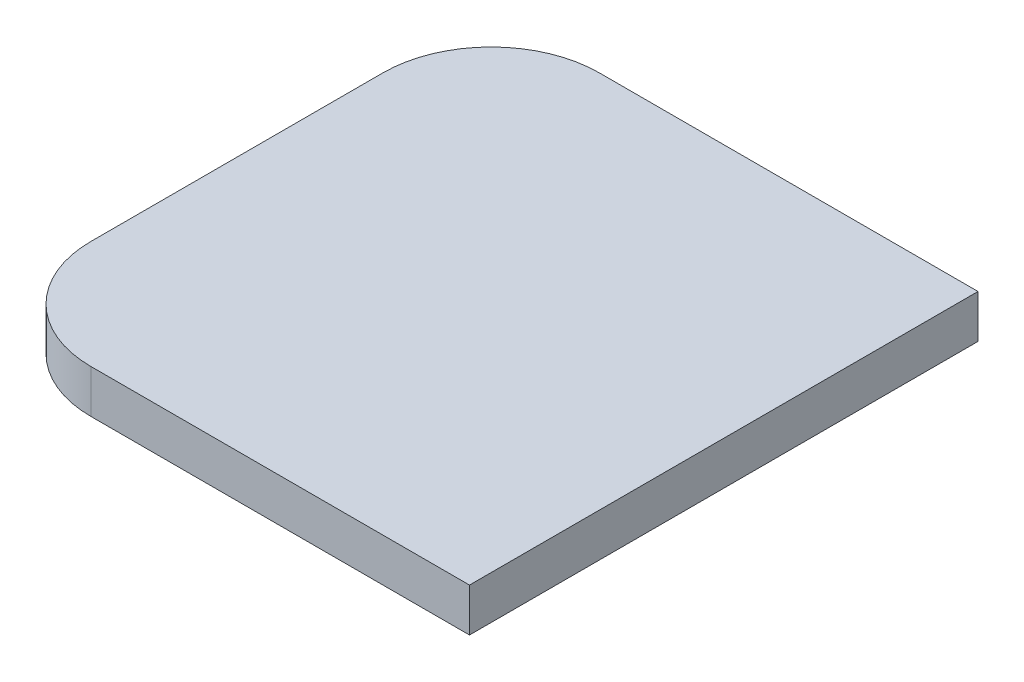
from build123d import *

# Parameters (mm, degrees)
SKETCH_1_W      = 4.5
SKETCH_1_H      = 4.7
EXTRUDE_1_DEPTH = 0.4
FILLET_1_R      = 1


with BuildPart() as part:
    # Sketch 1 → Extrude 1 (new body)
    with BuildSketch(Plane(origin=(0, 0, 0), x_dir=(1, 0, 0), z_dir=(0, 1, 0))):
        Rectangle(SKETCH_1_W, SKETCH_1_H)
    extrude(amount=EXTRUDE_1_DEPTH)

    # Fillet 1
    fillet_1_edges = [part.edges().sort_by_distance(p)[0] for p in [
        (-2.25, 0.2, 2.35),
        (-2.25, 0.2, -2.35),
    ]]
    fillet(fillet_1_edges, radius=FILLET_1_R)


solid = part.part
